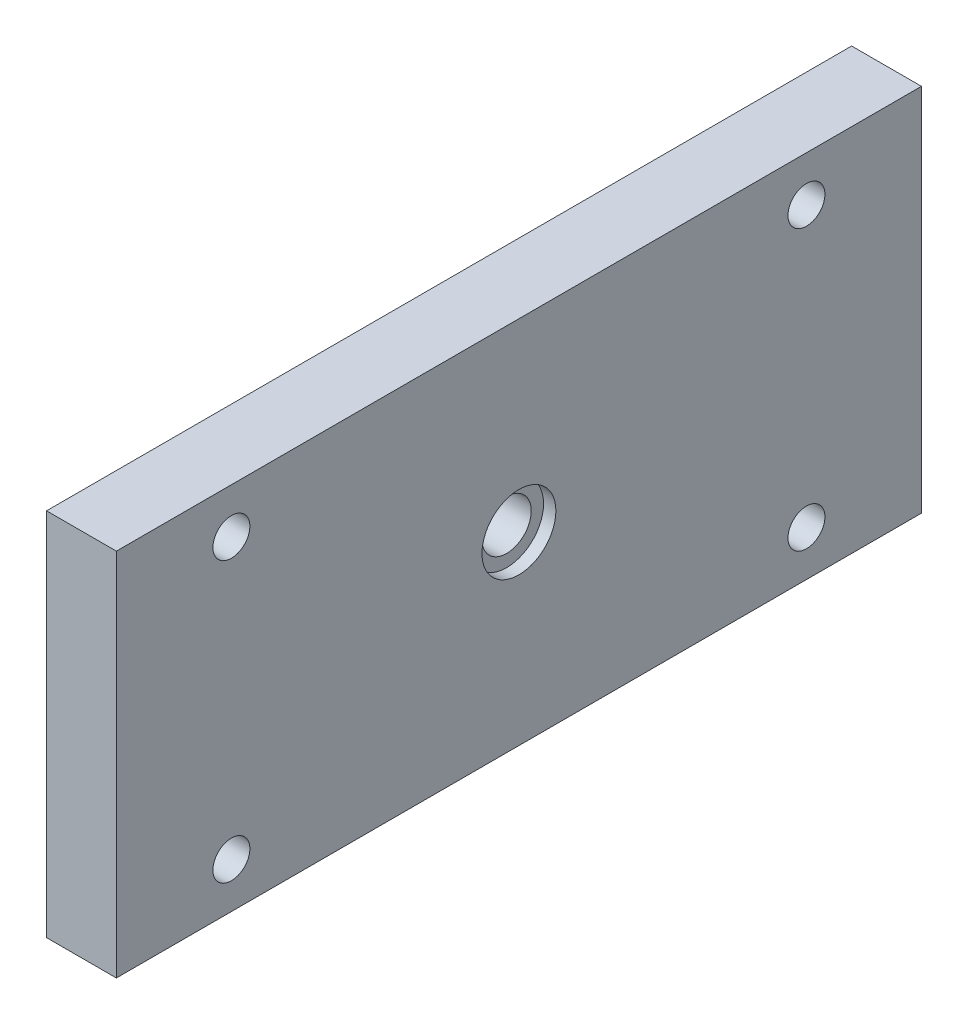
ISO-10303-21;
HEADER;
FILE_DESCRIPTION(('STEP AP214'),'2;1');
FILE_NAME('part.step','',(''),(''),'','','');
FILE_SCHEMA(('AUTOMOTIVE_DESIGN { 1 0 10303 214 1 1 1 1 }'));
ENDSEC;
DATA;
#1=APPLICATION_CONTEXT('core data for automotive mechanical design processes');
#2=APPLICATION_PROTOCOL_DEFINITION('international standard','automotive_design',2000,#1);
#3=PRODUCT_CONTEXT('',#1,'mechanical');
#4=PRODUCT('Part','Part','',(#3));
#5=PRODUCT_RELATED_PRODUCT_CATEGORY('part','',(#4));
#6=PRODUCT_DEFINITION_FORMATION('','',#4);
#7=PRODUCT_DEFINITION_CONTEXT('part definition',#1,'design');
#8=PRODUCT_DEFINITION('design','',#6,#7);
#9=PRODUCT_DEFINITION_SHAPE('','',#8);
#10=(LENGTH_UNIT() NAMED_UNIT(*) SI_UNIT(.MILLI.,.METRE.));
#11=(NAMED_UNIT(*) PLANE_ANGLE_UNIT() SI_UNIT($,.RADIAN.));
#12=(NAMED_UNIT(*) SI_UNIT($,.STERADIAN.) SOLID_ANGLE_UNIT());
#13=UNCERTAINTY_MEASURE_WITH_UNIT(LENGTH_MEASURE(1.E-05),#10,'distance_accuracy_value','');
#14=(GEOMETRIC_REPRESENTATION_CONTEXT(3) GLOBAL_UNCERTAINTY_ASSIGNED_CONTEXT((#13)) GLOBAL_UNIT_ASSIGNED_CONTEXT((#10,
#11,#12)) REPRESENTATION_CONTEXT('',''));
#15=CARTESIAN_POINT('',(0.,0.,0.));
#16=DIRECTION('',(0.,0.,1.));
#17=DIRECTION('',(1.,0.,0.));
#18=AXIS2_PLACEMENT_3D('',#15,#16,#17);
#19=CARTESIAN_POINT('',(-128.,78.0000000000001,98.0000000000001));
#20=DIRECTION('',(-1.,0.,0.));
#21=DIRECTION('',(0.,0.,1.));
#22=AXIS2_PLACEMENT_3D('',#19,#20,#21);
#23=CYLINDRICAL_SURFACE('',#22,6.);
#24=CARTESIAN_POINT('',(-145.,78.0000000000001,98.0000000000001));
#25=DIRECTION('',(-1.,0.,0.));
#26=DIRECTION('',(0.,0.,1.));
#27=AXIS2_PLACEMENT_3D('',#24,#25,#26);
#28=CIRCLE('',#27,6.);
#29=CARTESIAN_POINT('',(-145.,78.0000000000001,104.));
#30=VERTEX_POINT('',#29);
#31=EDGE_CURVE('E93',#30,#30,#28,.T.);
#32=ORIENTED_EDGE('',*,*,#31,.T.);
#33=EDGE_LOOP('',(#32));
#34=FACE_BOUND('',#33,.T.);
#35=CARTESIAN_POINT('',(-131.,78.0000000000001,98.0000000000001));
#36=DIRECTION('',(1.,0.,0.));
#37=DIRECTION('',(0.,0.,-1.));
#38=AXIS2_PLACEMENT_3D('',#35,#36,#37);
#39=CIRCLE('',#38,6.);
#40=CARTESIAN_POINT('',(-131.,78.0000000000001,92.0000000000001));
#41=VERTEX_POINT('',#40);
#42=EDGE_CURVE('E36',#41,#41,#39,.F.);
#43=ORIENTED_EDGE('',*,*,#42,.F.);
#44=EDGE_LOOP('',(#43));
#45=FACE_BOUND('',#44,.T.);
#46=ADVANCED_FACE('F32',(#34,#45),#23,.F.);
#47=CARTESIAN_POINT('',(-145.,78.0000000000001,98.0000000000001));
#48=DIRECTION('',(-1.,0.,0.));
#49=DIRECTION('',(0.,0.,1.));
#50=AXIS2_PLACEMENT_3D('',#47,#48,#49);
#51=PLANE('',#50);
#52=ORIENTED_EDGE('',*,*,#31,.F.);
#53=EDGE_LOOP('',(#52));
#54=FACE_BOUND('',#53,.T.);
#55=CARTESIAN_POINT('',(-145.,112.,184.));
#56=DIRECTION('',(-1.,0.,0.));
#57=DIRECTION('',(0.,0.,1.));
#58=AXIS2_PLACEMENT_3D('',#55,#56,#57);
#59=CIRCLE('',#58,1.65);
#60=CARTESIAN_POINT('',(-145.,112.,185.65));
#61=VERTEX_POINT('',#60);
#62=EDGE_CURVE('E92',#61,#61,#59,.T.);
#63=ORIENTED_EDGE('',*,*,#62,.F.);
#64=EDGE_LOOP('',(#63));
#65=FACE_BOUND('',#64,.T.);
#66=CARTESIAN_POINT('',(-145.,112.,12.));
#67=DIRECTION('',(-1.,0.,0.));
#68=DIRECTION('',(0.,0.,1.));
#69=AXIS2_PLACEMENT_3D('',#66,#67,#68);
#70=CIRCLE('',#69,1.65);
#71=CARTESIAN_POINT('',(-145.,112.,13.65));
#72=VERTEX_POINT('',#71);
#73=EDGE_CURVE('E103',#72,#72,#70,.T.);
#74=ORIENTED_EDGE('',*,*,#73,.F.);
#75=EDGE_LOOP('',(#74));
#76=FACE_BOUND('',#75,.T.);
#77=CARTESIAN_POINT('',(-145.,44.,184.));
#78=DIRECTION('',(-1.,0.,0.));
#79=DIRECTION('',(0.,0.,1.));
#80=AXIS2_PLACEMENT_3D('',#77,#78,#79);
#81=CIRCLE('',#80,1.65);
#82=CARTESIAN_POINT('',(-145.,44.,185.65));
#83=VERTEX_POINT('',#82);
#84=EDGE_CURVE('E107',#83,#83,#81,.T.);
#85=ORIENTED_EDGE('',*,*,#84,.F.);
#86=EDGE_LOOP('',(#85));
#87=FACE_BOUND('',#86,.T.);
#88=CARTESIAN_POINT('',(-145.,44.,12.));
#89=DIRECTION('',(-1.,0.,0.));
#90=DIRECTION('',(0.,0.,1.));
#91=AXIS2_PLACEMENT_3D('',#88,#89,#90);
#92=CIRCLE('',#91,1.65);
#93=CARTESIAN_POINT('',(-145.,44.,13.65));
#94=VERTEX_POINT('',#93);
#95=EDGE_CURVE('E111',#94,#94,#92,.T.);
#96=ORIENTED_EDGE('',*,*,#95,.F.);
#97=EDGE_LOOP('',(#96));
#98=FACE_BOUND('',#97,.T.);
#99=CARTESIAN_POINT('',(-145.,112.,168.));
#100=DIRECTION('',(-1.,0.,0.));
#101=DIRECTION('',(0.,0.,1.));
#102=AXIS2_PLACEMENT_3D('',#99,#100,#101);
#103=CIRCLE('',#102,7.5);
#104=CARTESIAN_POINT('',(-145.,112.,175.5));
#105=VERTEX_POINT('',#104);
#106=EDGE_CURVE('E123',#105,#105,#103,.T.);
#107=ORIENTED_EDGE('',*,*,#106,.F.);
#108=EDGE_LOOP('',(#107));
#109=FACE_BOUND('',#108,.T.);
#110=CARTESIAN_POINT('',(-145.,112.,28.));
#111=DIRECTION('',(-1.,0.,0.));
#112=DIRECTION('',(0.,0.,1.));
#113=AXIS2_PLACEMENT_3D('',#110,#111,#112);
#114=CIRCLE('',#113,7.5);
#115=CARTESIAN_POINT('',(-145.,112.,35.5));
#116=VERTEX_POINT('',#115);
#117=EDGE_CURVE('E131',#116,#116,#114,.T.);
#118=ORIENTED_EDGE('',*,*,#117,.F.);
#119=EDGE_LOOP('',(#118));
#120=FACE_BOUND('',#119,.T.);
#121=CARTESIAN_POINT('',(-145.,44.,168.));
#122=DIRECTION('',(-1.,0.,0.));
#123=DIRECTION('',(0.,0.,1.));
#124=AXIS2_PLACEMENT_3D('',#121,#122,#123);
#125=CIRCLE('',#124,7.5);
#126=CARTESIAN_POINT('',(-145.,44.,175.5));
#127=VERTEX_POINT('',#126);
#128=EDGE_CURVE('E139',#127,#127,#125,.T.);
#129=ORIENTED_EDGE('',*,*,#128,.F.);
#130=EDGE_LOOP('',(#129));
#131=FACE_BOUND('',#130,.T.);
#132=CARTESIAN_POINT('',(-145.,44.,28.));
#133=DIRECTION('',(-1.,0.,0.));
#134=DIRECTION('',(0.,0.,1.));
#135=AXIS2_PLACEMENT_3D('',#132,#133,#134);
#136=CIRCLE('',#135,7.5);
#137=CARTESIAN_POINT('',(-145.,44.,35.5));
#138=VERTEX_POINT('',#137);
#139=EDGE_CURVE('E147',#138,#138,#136,.T.);
#140=ORIENTED_EDGE('',*,*,#139,.F.);
#141=EDGE_LOOP('',(#140));
#142=FACE_BOUND('',#141,.T.);
#143=DIRECTION('',(0.,0.,-1.));
#144=VECTOR('',#143,1.);
#145=CARTESIAN_POINT('',(-145.,33.,98.0000000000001));
#146=LINE('',#145,#144);
#147=CARTESIAN_POINT('',(-145.,33.,196.));
#148=VERTEX_POINT('',#147);
#149=CARTESIAN_POINT('',(-145.,33.,0.));
#150=VERTEX_POINT('',#149);
#151=EDGE_CURVE('E11',#148,#150,#146,.T.);
#152=ORIENTED_EDGE('',*,*,#151,.F.);
#153=DIRECTION('',(0.,-1.,0.));
#154=VECTOR('',#153,1.);
#155=CARTESIAN_POINT('',(-145.,78.0000000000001,196.));
#156=LINE('',#155,#154);
#157=CARTESIAN_POINT('',(-145.,123.,196.));
#158=VERTEX_POINT('',#157);
#159=EDGE_CURVE('E166',#158,#148,#156,.T.);
#160=ORIENTED_EDGE('',*,*,#159,.F.);
#161=DIRECTION('',(0.,0.,1.));
#162=VECTOR('',#161,1.);
#163=CARTESIAN_POINT('',(-145.,123.,98.0000000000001));
#164=LINE('',#163,#162);
#165=CARTESIAN_POINT('',(-145.,123.,0.));
#166=VERTEX_POINT('',#165);
#167=EDGE_CURVE('E169',#166,#158,#164,.T.);
#168=ORIENTED_EDGE('',*,*,#167,.F.);
#169=DIRECTION('',(0.,1.,0.));
#170=VECTOR('',#169,1.);
#171=CARTESIAN_POINT('',(-145.,78.0000000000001,0.));
#172=LINE('',#171,#170);
#173=EDGE_CURVE('E41',#150,#166,#172,.T.);
#174=ORIENTED_EDGE('',*,*,#173,.F.);
#175=EDGE_LOOP('',(#152,#160,#168,#174));
#176=FACE_BOUND('',#175,.T.);
#177=ADVANCED_FACE('F34',(#54,#65,#76,#87,#98,#109,#120,#131,#142,#176),#51,.T.);
#178=CARTESIAN_POINT('',(-128.,33.,98.0000000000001));
#179=DIRECTION('',(0.,-1.,0.));
#180=DIRECTION('',(1.,0.,0.));
#181=AXIS2_PLACEMENT_3D('',#178,#179,#180);
#182=PLANE('',#181);
#183=DIRECTION('',(-1.,0.,0.));
#184=VECTOR('',#183,1.);
#185=CARTESIAN_POINT('',(-128.,33.,196.));
#186=LINE('',#185,#184);
#187=CARTESIAN_POINT('',(-128.,33.,196.));
#188=VERTEX_POINT('',#187);
#189=EDGE_CURVE('E151',#188,#148,#186,.T.);
#190=ORIENTED_EDGE('',*,*,#189,.T.);
#191=ORIENTED_EDGE('',*,*,#151,.T.);
#192=DIRECTION('',(-1.,0.,0.));
#193=VECTOR('',#192,1.);
#194=CARTESIAN_POINT('',(-128.,33.,0.));
#195=LINE('',#194,#193);
#196=CARTESIAN_POINT('',(-128.,33.,0.));
#197=VERTEX_POINT('',#196);
#198=EDGE_CURVE('E164',#197,#150,#195,.T.);
#199=ORIENTED_EDGE('',*,*,#198,.F.);
#200=DIRECTION('',(0.,0.,1.));
#201=VECTOR('',#200,1.);
#202=CARTESIAN_POINT('',(-128.,33.,98.0000000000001));
#203=LINE('',#202,#201);
#204=EDGE_CURVE('E143',#197,#188,#203,.T.);
#205=ORIENTED_EDGE('',*,*,#204,.T.);
#206=EDGE_LOOP('',(#190,#191,#199,#205));
#207=FACE_BOUND('',#206,.T.);
#208=ADVANCED_FACE('F199',(#207),#182,.T.);
#209=CARTESIAN_POINT('',(-128.,78.0000000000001,0.));
#210=DIRECTION('',(0.,0.,-1.));
#211=DIRECTION('',(-1.,0.,0.));
#212=AXIS2_PLACEMENT_3D('',#209,#210,#211);
#213=PLANE('',#212);
#214=ORIENTED_EDGE('',*,*,#198,.T.);
#215=ORIENTED_EDGE('',*,*,#173,.T.);
#216=DIRECTION('',(-1.,0.,0.));
#217=VECTOR('',#216,1.);
#218=CARTESIAN_POINT('',(-128.,123.,0.));
#219=LINE('',#218,#217);
#220=CARTESIAN_POINT('',(-128.,123.,0.));
#221=VERTEX_POINT('',#220);
#222=EDGE_CURVE('E161',#221,#166,#219,.T.);
#223=ORIENTED_EDGE('',*,*,#222,.F.);
#224=DIRECTION('',(0.,-1.,0.));
#225=VECTOR('',#224,1.);
#226=CARTESIAN_POINT('',(-128.,78.0000000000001,0.));
#227=LINE('',#226,#225);
#228=EDGE_CURVE('E146',#221,#197,#227,.T.);
#229=ORIENTED_EDGE('',*,*,#228,.T.);
#230=EDGE_LOOP('',(#214,#215,#223,#229));
#231=FACE_BOUND('',#230,.T.);
#232=ADVANCED_FACE('F224',(#231),#213,.T.);
#233=CARTESIAN_POINT('',(-128.,123.,98.0000000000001));
#234=DIRECTION('',(0.,1.,0.));
#235=DIRECTION('',(-1.,0.,0.));
#236=AXIS2_PLACEMENT_3D('',#233,#234,#235);
#237=PLANE('',#236);
#238=ORIENTED_EDGE('',*,*,#222,.T.);
#239=ORIENTED_EDGE('',*,*,#167,.T.);
#240=DIRECTION('',(-1.,0.,0.));
#241=VECTOR('',#240,1.);
#242=CARTESIAN_POINT('',(-128.,123.,196.));
#243=LINE('',#242,#241);
#244=CARTESIAN_POINT('',(-128.,123.,196.));
#245=VERTEX_POINT('',#244);
#246=EDGE_CURVE('E158',#245,#158,#243,.T.);
#247=ORIENTED_EDGE('',*,*,#246,.F.);
#248=DIRECTION('',(0.,0.,-1.));
#249=VECTOR('',#248,1.);
#250=CARTESIAN_POINT('',(-128.,123.,98.0000000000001));
#251=LINE('',#250,#249);
#252=EDGE_CURVE('E152',#245,#221,#251,.T.);
#253=ORIENTED_EDGE('',*,*,#252,.T.);
#254=EDGE_LOOP('',(#238,#239,#247,#253));
#255=FACE_BOUND('',#254,.T.);
#256=ADVANCED_FACE('F223',(#255),#237,.T.);
#257=CARTESIAN_POINT('',(-128.,78.0000000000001,98.0000000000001));
#258=DIRECTION('',(1.,0.,0.));
#259=DIRECTION('',(0.,0.,-1.));
#260=AXIS2_PLACEMENT_3D('',#257,#258,#259);
#261=PLANE('',#260);
#262=CARTESIAN_POINT('',(-128.,78.0000000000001,98.0000000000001));
#263=DIRECTION('',(1.,0.,0.));
#264=DIRECTION('',(0.,0.,-1.));
#265=AXIS2_PLACEMENT_3D('',#262,#263,#264);
#266=CIRCLE('',#265,8.99999999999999);
#267=CARTESIAN_POINT('',(-128.,78.0000000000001,89.0000000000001));
#268=VERTEX_POINT('',#267);
#269=EDGE_CURVE('E427',#268,#268,#266,.T.);
#270=ORIENTED_EDGE('',*,*,#269,.F.);
#271=EDGE_LOOP('',(#270));
#272=FACE_BOUND('',#271,.T.);
#273=CARTESIAN_POINT('',(-128.,112.,168.));
#274=DIRECTION('',(1.,0.,0.));
#275=DIRECTION('',(0.,0.,-1.));
#276=AXIS2_PLACEMENT_3D('',#273,#274,#275);
#277=CIRCLE('',#276,4.5);
#278=CARTESIAN_POINT('',(-128.,112.,163.5));
#279=VERTEX_POINT('',#278);
#280=EDGE_CURVE('E118',#279,#279,#277,.T.);
#281=ORIENTED_EDGE('',*,*,#280,.F.);
#282=EDGE_LOOP('',(#281));
#283=FACE_BOUND('',#282,.T.);
#284=CARTESIAN_POINT('',(-128.,112.,28.));
#285=DIRECTION('',(1.,0.,0.));
#286=DIRECTION('',(0.,0.,-1.));
#287=AXIS2_PLACEMENT_3D('',#284,#285,#286);
#288=CIRCLE('',#287,4.5);
#289=CARTESIAN_POINT('',(-128.,112.,23.5));
#290=VERTEX_POINT('',#289);
#291=EDGE_CURVE('E126',#290,#290,#288,.T.);
#292=ORIENTED_EDGE('',*,*,#291,.F.);
#293=EDGE_LOOP('',(#292));
#294=FACE_BOUND('',#293,.T.);
#295=CARTESIAN_POINT('',(-128.,44.,168.));
#296=DIRECTION('',(1.,0.,0.));
#297=DIRECTION('',(0.,0.,-1.));
#298=AXIS2_PLACEMENT_3D('',#295,#296,#297);
#299=CIRCLE('',#298,4.5);
#300=CARTESIAN_POINT('',(-128.,44.,163.5));
#301=VERTEX_POINT('',#300);
#302=EDGE_CURVE('E134',#301,#301,#299,.T.);
#303=ORIENTED_EDGE('',*,*,#302,.F.);
#304=EDGE_LOOP('',(#303));
#305=FACE_BOUND('',#304,.T.);
#306=CARTESIAN_POINT('',(-128.,44.,28.));
#307=DIRECTION('',(1.,0.,0.));
#308=DIRECTION('',(0.,0.,-1.));
#309=AXIS2_PLACEMENT_3D('',#306,#307,#308);
#310=CIRCLE('',#309,4.5);
#311=CARTESIAN_POINT('',(-128.,44.,23.5));
#312=VERTEX_POINT('',#311);
#313=EDGE_CURVE('E142',#312,#312,#310,.T.);
#314=ORIENTED_EDGE('',*,*,#313,.F.);
#315=EDGE_LOOP('',(#314));
#316=FACE_BOUND('',#315,.T.);
#317=DIRECTION('',(0.,1.,0.));
#318=VECTOR('',#317,1.);
#319=CARTESIAN_POINT('',(-128.,78.0000000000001,196.));
#320=LINE('',#319,#318);
#321=EDGE_CURVE('E148',#188,#245,#320,.T.);
#322=ORIENTED_EDGE('',*,*,#321,.F.);
#323=ORIENTED_EDGE('',*,*,#204,.F.);
#324=ORIENTED_EDGE('',*,*,#228,.F.);
#325=ORIENTED_EDGE('',*,*,#252,.F.);
#326=EDGE_LOOP('',(#322,#323,#324,#325));
#327=FACE_BOUND('',#326,.T.);
#328=ADVANCED_FACE('F221',(#272,#283,#294,#305,#316,#327),#261,.T.);
#329=CARTESIAN_POINT('',(-128.,78.0000000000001,196.));
#330=DIRECTION('',(0.,0.,1.));
#331=DIRECTION('',(1.,0.,0.));
#332=AXIS2_PLACEMENT_3D('',#329,#330,#331);
#333=PLANE('',#332);
#334=ORIENTED_EDGE('',*,*,#321,.T.);
#335=ORIENTED_EDGE('',*,*,#246,.T.);
#336=ORIENTED_EDGE('',*,*,#159,.T.);
#337=ORIENTED_EDGE('',*,*,#189,.F.);
#338=EDGE_LOOP('',(#334,#335,#336,#337));
#339=FACE_BOUND('',#338,.T.);
#340=ADVANCED_FACE('F215',(#339),#333,.T.);
#341=CARTESIAN_POINT('',(-145.,44.,28.));
#342=DIRECTION('',(-1.,0.,0.));
#343=DIRECTION('',(0.,0.,1.));
#344=AXIS2_PLACEMENT_3D('',#341,#342,#343);
#345=CYLINDRICAL_SURFACE('',#344,4.5);
#346=ORIENTED_EDGE('',*,*,#313,.T.);
#347=EDGE_LOOP('',(#346));
#348=FACE_BOUND('',#347,.T.);
#349=CARTESIAN_POINT('',(-136.,44.,28.));
#350=DIRECTION('',(-1.,0.,0.));
#351=DIRECTION('',(0.,0.,1.));
#352=AXIS2_PLACEMENT_3D('',#349,#350,#351);
#353=CIRCLE('',#352,4.5);
#354=CARTESIAN_POINT('',(-136.,44.,32.5));
#355=VERTEX_POINT('',#354);
#356=EDGE_CURVE('E138',#355,#355,#353,.T.);
#357=ORIENTED_EDGE('',*,*,#356,.T.);
#358=EDGE_LOOP('',(#357));
#359=FACE_BOUND('',#358,.T.);
#360=ADVANCED_FACE('F311',(#348,#359),#345,.F.);
#361=CARTESIAN_POINT('',(-136.,51.5000000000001,28.));
#362=DIRECTION('',(1.,0.,0.));
#363=DIRECTION('',(0.,0.,-1.));
#364=AXIS2_PLACEMENT_3D('',#361,#362,#363);
#365=PLANE('',#364);
#366=ORIENTED_EDGE('',*,*,#356,.F.);
#367=EDGE_LOOP('',(#366));
#368=FACE_BOUND('',#367,.T.);
#369=CARTESIAN_POINT('',(-136.,44.,28.));
#370=DIRECTION('',(-1.,0.,0.));
#371=DIRECTION('',(0.,0.,1.));
#372=AXIS2_PLACEMENT_3D('',#369,#370,#371);
#373=CIRCLE('',#372,7.5);
#374=CARTESIAN_POINT('',(-136.,44.,35.5));
#375=VERTEX_POINT('',#374);
#376=EDGE_CURVE('E135',#375,#375,#373,.T.);
#377=ORIENTED_EDGE('',*,*,#376,.T.);
#378=EDGE_LOOP('',(#377));
#379=FACE_BOUND('',#378,.T.);
#380=ADVANCED_FACE('F307',(#368,#379),#365,.F.);
#381=CARTESIAN_POINT('',(-145.,44.,28.));
#382=DIRECTION('',(-1.,0.,0.));
#383=DIRECTION('',(0.,0.,1.));
#384=AXIS2_PLACEMENT_3D('',#381,#382,#383);
#385=CYLINDRICAL_SURFACE('',#384,7.5);
#386=ORIENTED_EDGE('',*,*,#139,.T.);
#387=EDGE_LOOP('',(#386));
#388=FACE_BOUND('',#387,.T.);
#389=ORIENTED_EDGE('',*,*,#376,.F.);
#390=EDGE_LOOP('',(#389));
#391=FACE_BOUND('',#390,.T.);
#392=ADVANCED_FACE('F303',(#388,#391),#385,.F.);
#393=CARTESIAN_POINT('',(-145.,44.,168.));
#394=DIRECTION('',(-1.,0.,0.));
#395=DIRECTION('',(0.,0.,1.));
#396=AXIS2_PLACEMENT_3D('',#393,#394,#395);
#397=CYLINDRICAL_SURFACE('',#396,4.5);
#398=ORIENTED_EDGE('',*,*,#302,.T.);
#399=EDGE_LOOP('',(#398));
#400=FACE_BOUND('',#399,.T.);
#401=CARTESIAN_POINT('',(-136.,44.,168.));
#402=DIRECTION('',(-1.,0.,0.));
#403=DIRECTION('',(0.,0.,1.));
#404=AXIS2_PLACEMENT_3D('',#401,#402,#403);
#405=CIRCLE('',#404,4.5);
#406=CARTESIAN_POINT('',(-136.,44.,172.5));
#407=VERTEX_POINT('',#406);
#408=EDGE_CURVE('E130',#407,#407,#405,.T.);
#409=ORIENTED_EDGE('',*,*,#408,.T.);
#410=EDGE_LOOP('',(#409));
#411=FACE_BOUND('',#410,.T.);
#412=ADVANCED_FACE('F299',(#400,#411),#397,.F.);
#413=CARTESIAN_POINT('',(-136.,51.5000000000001,168.));
#414=DIRECTION('',(1.,0.,0.));
#415=DIRECTION('',(0.,0.,-1.));
#416=AXIS2_PLACEMENT_3D('',#413,#414,#415);
#417=PLANE('',#416);
#418=ORIENTED_EDGE('',*,*,#408,.F.);
#419=EDGE_LOOP('',(#418));
#420=FACE_BOUND('',#419,.T.);
#421=CARTESIAN_POINT('',(-136.,44.,168.));
#422=DIRECTION('',(-1.,0.,0.));
#423=DIRECTION('',(0.,0.,1.));
#424=AXIS2_PLACEMENT_3D('',#421,#422,#423);
#425=CIRCLE('',#424,7.5);
#426=CARTESIAN_POINT('',(-136.,44.,175.5));
#427=VERTEX_POINT('',#426);
#428=EDGE_CURVE('E127',#427,#427,#425,.T.);
#429=ORIENTED_EDGE('',*,*,#428,.T.);
#430=EDGE_LOOP('',(#429));
#431=FACE_BOUND('',#430,.T.);
#432=ADVANCED_FACE('F295',(#420,#431),#417,.F.);
#433=CARTESIAN_POINT('',(-145.,44.,168.));
#434=DIRECTION('',(-1.,0.,0.));
#435=DIRECTION('',(0.,0.,1.));
#436=AXIS2_PLACEMENT_3D('',#433,#434,#435);
#437=CYLINDRICAL_SURFACE('',#436,7.5);
#438=ORIENTED_EDGE('',*,*,#128,.T.);
#439=EDGE_LOOP('',(#438));
#440=FACE_BOUND('',#439,.T.);
#441=ORIENTED_EDGE('',*,*,#428,.F.);
#442=EDGE_LOOP('',(#441));
#443=FACE_BOUND('',#442,.T.);
#444=ADVANCED_FACE('F291',(#440,#443),#437,.F.);
#445=CARTESIAN_POINT('',(-145.,112.,28.));
#446=DIRECTION('',(-1.,0.,0.));
#447=DIRECTION('',(0.,0.,1.));
#448=AXIS2_PLACEMENT_3D('',#445,#446,#447);
#449=CYLINDRICAL_SURFACE('',#448,4.5);
#450=ORIENTED_EDGE('',*,*,#291,.T.);
#451=EDGE_LOOP('',(#450));
#452=FACE_BOUND('',#451,.T.);
#453=CARTESIAN_POINT('',(-136.,112.,28.));
#454=DIRECTION('',(-1.,0.,0.));
#455=DIRECTION('',(0.,0.,1.));
#456=AXIS2_PLACEMENT_3D('',#453,#454,#455);
#457=CIRCLE('',#456,4.5);
#458=CARTESIAN_POINT('',(-136.,112.,32.5));
#459=VERTEX_POINT('',#458);
#460=EDGE_CURVE('E122',#459,#459,#457,.T.);
#461=ORIENTED_EDGE('',*,*,#460,.T.);
#462=EDGE_LOOP('',(#461));
#463=FACE_BOUND('',#462,.T.);
#464=ADVANCED_FACE('F287',(#452,#463),#449,.F.);
#465=CARTESIAN_POINT('',(-136.,119.5,28.));
#466=DIRECTION('',(1.,0.,0.));
#467=DIRECTION('',(0.,0.,-1.));
#468=AXIS2_PLACEMENT_3D('',#465,#466,#467);
#469=PLANE('',#468);
#470=ORIENTED_EDGE('',*,*,#460,.F.);
#471=EDGE_LOOP('',(#470));
#472=FACE_BOUND('',#471,.T.);
#473=CARTESIAN_POINT('',(-136.,112.,28.));
#474=DIRECTION('',(-1.,0.,0.));
#475=DIRECTION('',(0.,0.,1.));
#476=AXIS2_PLACEMENT_3D('',#473,#474,#475);
#477=CIRCLE('',#476,7.5);
#478=CARTESIAN_POINT('',(-136.,112.,35.5));
#479=VERTEX_POINT('',#478);
#480=EDGE_CURVE('E119',#479,#479,#477,.T.);
#481=ORIENTED_EDGE('',*,*,#480,.T.);
#482=EDGE_LOOP('',(#481));
#483=FACE_BOUND('',#482,.T.);
#484=ADVANCED_FACE('F283',(#472,#483),#469,.F.);
#485=CARTESIAN_POINT('',(-145.,112.,28.));
#486=DIRECTION('',(-1.,0.,0.));
#487=DIRECTION('',(0.,0.,1.));
#488=AXIS2_PLACEMENT_3D('',#485,#486,#487);
#489=CYLINDRICAL_SURFACE('',#488,7.5);
#490=ORIENTED_EDGE('',*,*,#117,.T.);
#491=EDGE_LOOP('',(#490));
#492=FACE_BOUND('',#491,.T.);
#493=ORIENTED_EDGE('',*,*,#480,.F.);
#494=EDGE_LOOP('',(#493));
#495=FACE_BOUND('',#494,.T.);
#496=ADVANCED_FACE('F279',(#492,#495),#489,.F.);
#497=CARTESIAN_POINT('',(-145.,112.,168.));
#498=DIRECTION('',(-1.,0.,0.));
#499=DIRECTION('',(0.,0.,1.));
#500=AXIS2_PLACEMENT_3D('',#497,#498,#499);
#501=CYLINDRICAL_SURFACE('',#500,4.5);
#502=ORIENTED_EDGE('',*,*,#280,.T.);
#503=EDGE_LOOP('',(#502));
#504=FACE_BOUND('',#503,.T.);
#505=CARTESIAN_POINT('',(-136.,112.,168.));
#506=DIRECTION('',(-1.,0.,0.));
#507=DIRECTION('',(0.,0.,1.));
#508=AXIS2_PLACEMENT_3D('',#505,#506,#507);
#509=CIRCLE('',#508,4.5);
#510=CARTESIAN_POINT('',(-136.,112.,172.5));
#511=VERTEX_POINT('',#510);
#512=EDGE_CURVE('E115',#511,#511,#509,.T.);
#513=ORIENTED_EDGE('',*,*,#512,.T.);
#514=EDGE_LOOP('',(#513));
#515=FACE_BOUND('',#514,.T.);
#516=ADVANCED_FACE('F275',(#504,#515),#501,.F.);
#517=CARTESIAN_POINT('',(-136.,119.5,168.));
#518=DIRECTION('',(1.,0.,0.));
#519=DIRECTION('',(0.,0.,-1.));
#520=AXIS2_PLACEMENT_3D('',#517,#518,#519);
#521=PLANE('',#520);
#522=ORIENTED_EDGE('',*,*,#512,.F.);
#523=EDGE_LOOP('',(#522));
#524=FACE_BOUND('',#523,.T.);
#525=CARTESIAN_POINT('',(-136.,112.,168.));
#526=DIRECTION('',(-1.,0.,0.));
#527=DIRECTION('',(0.,0.,1.));
#528=AXIS2_PLACEMENT_3D('',#525,#526,#527);
#529=CIRCLE('',#528,7.5);
#530=CARTESIAN_POINT('',(-136.,112.,175.5));
#531=VERTEX_POINT('',#530);
#532=EDGE_CURVE('E112',#531,#531,#529,.T.);
#533=ORIENTED_EDGE('',*,*,#532,.T.);
#534=EDGE_LOOP('',(#533));
#535=FACE_BOUND('',#534,.T.);
#536=ADVANCED_FACE('F271',(#524,#535),#521,.F.);
#537=CARTESIAN_POINT('',(-145.,112.,168.));
#538=DIRECTION('',(-1.,0.,0.));
#539=DIRECTION('',(0.,0.,1.));
#540=AXIS2_PLACEMENT_3D('',#537,#538,#539);
#541=CYLINDRICAL_SURFACE('',#540,7.5);
#542=ORIENTED_EDGE('',*,*,#106,.T.);
#543=EDGE_LOOP('',(#542));
#544=FACE_BOUND('',#543,.T.);
#545=ORIENTED_EDGE('',*,*,#532,.F.);
#546=EDGE_LOOP('',(#545));
#547=FACE_BOUND('',#546,.T.);
#548=ADVANCED_FACE('F267',(#544,#547),#541,.F.);
#549=CARTESIAN_POINT('',(-134.,44.,12.));
#550=DIRECTION('',(-1.,0.,0.));
#551=DIRECTION('',(0.,0.,1.));
#552=AXIS2_PLACEMENT_3D('',#549,#550,#551);
#553=CONICAL_SURFACE('',#552,1.65,1.18681170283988);
#554=CARTESIAN_POINT('',(-133.333333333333,44.,12.));
#555=VERTEX_POINT('',#554);
#556=VERTEX_LOOP('',#555);
#557=FACE_BOUND('',#556,.T.);
#558=CARTESIAN_POINT('',(-134.,44.,12.));
#559=DIRECTION('',(-1.,0.,0.));
#560=DIRECTION('',(0.,0.,1.));
#561=AXIS2_PLACEMENT_3D('',#558,#559,#560);
#562=CIRCLE('',#561,1.65);
#563=CARTESIAN_POINT('',(-134.,44.,13.65));
#564=VERTEX_POINT('',#563);
#565=EDGE_CURVE('E108',#564,#564,#562,.T.);
#566=ORIENTED_EDGE('',*,*,#565,.T.);
#567=EDGE_LOOP('',(#566));
#568=FACE_BOUND('',#567,.T.);
#569=ADVANCED_FACE('F263',(#557,#568),#553,.F.);
#570=CARTESIAN_POINT('',(-145.,44.,12.));
#571=DIRECTION('',(-1.,0.,0.));
#572=DIRECTION('',(0.,0.,1.));
#573=AXIS2_PLACEMENT_3D('',#570,#571,#572);
#574=CYLINDRICAL_SURFACE('',#573,1.65);
#575=ORIENTED_EDGE('',*,*,#95,.T.);
#576=EDGE_LOOP('',(#575));
#577=FACE_BOUND('',#576,.T.);
#578=ORIENTED_EDGE('',*,*,#565,.F.);
#579=EDGE_LOOP('',(#578));
#580=FACE_BOUND('',#579,.T.);
#581=ADVANCED_FACE('F259',(#577,#580),#574,.F.);
#582=CARTESIAN_POINT('',(-134.,44.,184.));
#583=DIRECTION('',(-1.,0.,0.));
#584=DIRECTION('',(0.,0.,1.));
#585=AXIS2_PLACEMENT_3D('',#582,#583,#584);
#586=CONICAL_SURFACE('',#585,1.65,1.18681170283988);
#587=CARTESIAN_POINT('',(-133.333333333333,44.,184.));
#588=VERTEX_POINT('',#587);
#589=VERTEX_LOOP('',#588);
#590=FACE_BOUND('',#589,.T.);
#591=CARTESIAN_POINT('',(-134.,44.,184.));
#592=DIRECTION('',(-1.,0.,0.));
#593=DIRECTION('',(0.,0.,1.));
#594=AXIS2_PLACEMENT_3D('',#591,#592,#593);
#595=CIRCLE('',#594,1.65);
#596=CARTESIAN_POINT('',(-134.,44.,185.65));
#597=VERTEX_POINT('',#596);
#598=EDGE_CURVE('E104',#597,#597,#595,.T.);
#599=ORIENTED_EDGE('',*,*,#598,.T.);
#600=EDGE_LOOP('',(#599));
#601=FACE_BOUND('',#600,.T.);
#602=ADVANCED_FACE('F255',(#590,#601),#586,.F.);
#603=CARTESIAN_POINT('',(-145.,44.,184.));
#604=DIRECTION('',(-1.,0.,0.));
#605=DIRECTION('',(0.,0.,1.));
#606=AXIS2_PLACEMENT_3D('',#603,#604,#605);
#607=CYLINDRICAL_SURFACE('',#606,1.65);
#608=ORIENTED_EDGE('',*,*,#84,.T.);
#609=EDGE_LOOP('',(#608));
#610=FACE_BOUND('',#609,.T.);
#611=ORIENTED_EDGE('',*,*,#598,.F.);
#612=EDGE_LOOP('',(#611));
#613=FACE_BOUND('',#612,.T.);
#614=ADVANCED_FACE('F251',(#610,#613),#607,.F.);
#615=CARTESIAN_POINT('',(-134.,112.,12.));
#616=DIRECTION('',(-1.,0.,0.));
#617=DIRECTION('',(0.,0.,1.));
#618=AXIS2_PLACEMENT_3D('',#615,#616,#617);
#619=CONICAL_SURFACE('',#618,1.65,1.18681170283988);
#620=CARTESIAN_POINT('',(-133.333333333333,112.,12.));
#621=VERTEX_POINT('',#620);
#622=VERTEX_LOOP('',#621);
#623=FACE_BOUND('',#622,.T.);
#624=CARTESIAN_POINT('',(-134.,112.,12.));
#625=DIRECTION('',(-1.,0.,0.));
#626=DIRECTION('',(0.,0.,1.));
#627=AXIS2_PLACEMENT_3D('',#624,#625,#626);
#628=CIRCLE('',#627,1.65);
#629=CARTESIAN_POINT('',(-134.,112.,13.65));
#630=VERTEX_POINT('',#629);
#631=EDGE_CURVE('E96',#630,#630,#628,.T.);
#632=ORIENTED_EDGE('',*,*,#631,.T.);
#633=EDGE_LOOP('',(#632));
#634=FACE_BOUND('',#633,.T.);
#635=ADVANCED_FACE('F248',(#623,#634),#619,.F.);
#636=CARTESIAN_POINT('',(-145.,112.,12.));
#637=DIRECTION('',(-1.,0.,0.));
#638=DIRECTION('',(0.,0.,1.));
#639=AXIS2_PLACEMENT_3D('',#636,#637,#638);
#640=CYLINDRICAL_SURFACE('',#639,1.65);
#641=ORIENTED_EDGE('',*,*,#73,.T.);
#642=EDGE_LOOP('',(#641));
#643=FACE_BOUND('',#642,.T.);
#644=ORIENTED_EDGE('',*,*,#631,.F.);
#645=EDGE_LOOP('',(#644));
#646=FACE_BOUND('',#645,.T.);
#647=ADVANCED_FACE('F86',(#643,#646),#640,.F.);
#648=CARTESIAN_POINT('',(-134.,112.,184.));
#649=DIRECTION('',(-1.,0.,0.));
#650=DIRECTION('',(0.,0.,1.));
#651=AXIS2_PLACEMENT_3D('',#648,#649,#650);
#652=CONICAL_SURFACE('',#651,1.65,1.18681170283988);
#653=CARTESIAN_POINT('',(-133.333333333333,112.,184.));
#654=VERTEX_POINT('',#653);
#655=VERTEX_LOOP('',#654);
#656=FACE_BOUND('',#655,.T.);
#657=CARTESIAN_POINT('',(-134.,112.,184.));
#658=DIRECTION('',(-1.,0.,0.));
#659=DIRECTION('',(0.,0.,1.));
#660=AXIS2_PLACEMENT_3D('',#657,#658,#659);
#661=CIRCLE('',#660,1.65);
#662=CARTESIAN_POINT('',(-134.,112.,185.65));
#663=VERTEX_POINT('',#662);
#664=EDGE_CURVE('E90',#663,#663,#661,.T.);
#665=ORIENTED_EDGE('',*,*,#664,.T.);
#666=EDGE_LOOP('',(#665));
#667=FACE_BOUND('',#666,.T.);
#668=ADVANCED_FACE('F82',(#656,#667),#652,.F.);
#669=CARTESIAN_POINT('',(-145.,112.,184.));
#670=DIRECTION('',(-1.,0.,0.));
#671=DIRECTION('',(0.,0.,1.));
#672=AXIS2_PLACEMENT_3D('',#669,#670,#671);
#673=CYLINDRICAL_SURFACE('',#672,1.65);
#674=ORIENTED_EDGE('',*,*,#62,.T.);
#675=EDGE_LOOP('',(#674));
#676=FACE_BOUND('',#675,.T.);
#677=ORIENTED_EDGE('',*,*,#664,.F.);
#678=EDGE_LOOP('',(#677));
#679=FACE_BOUND('',#678,.T.);
#680=ADVANCED_FACE('F85',(#676,#679),#673,.F.);
#681=CARTESIAN_POINT('',(-131.,78.0000000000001,98.0000000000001));
#682=DIRECTION('',(1.,0.,0.));
#683=DIRECTION('',(0.,0.,-1.));
#684=AXIS2_PLACEMENT_3D('',#681,#682,#683);
#685=PLANE('',#684);
#686=CARTESIAN_POINT('',(-131.,78.0000000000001,98.0000000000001));
#687=DIRECTION('',(1.,0.,0.));
#688=DIRECTION('',(0.,0.,-1.));
#689=AXIS2_PLACEMENT_3D('',#686,#687,#688);
#690=CIRCLE('',#689,8.99999999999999);
#691=CARTESIAN_POINT('',(-131.,78.0000000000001,89.0000000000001));
#692=VERTEX_POINT('',#691);
#693=EDGE_CURVE('E424',#692,#692,#690,.T.);
#694=ORIENTED_EDGE('',*,*,#693,.T.);
#695=EDGE_LOOP('',(#694));
#696=FACE_BOUND('',#695,.T.);
#697=ORIENTED_EDGE('',*,*,#42,.T.);
#698=EDGE_LOOP('',(#697));
#699=FACE_BOUND('',#698,.T.);
#700=ADVANCED_FACE('F243',(#696,#699),#685,.T.);
#701=CARTESIAN_POINT('',(-131.,78.0000000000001,98.0000000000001));
#702=DIRECTION('',(1.,0.,0.));
#703=DIRECTION('',(0.,0.,-1.));
#704=AXIS2_PLACEMENT_3D('',#701,#702,#703);
#705=CYLINDRICAL_SURFACE('',#704,8.99999999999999);
#706=ORIENTED_EDGE('',*,*,#693,.F.);
#707=EDGE_LOOP('',(#706));
#708=FACE_BOUND('',#707,.T.);
#709=ORIENTED_EDGE('',*,*,#269,.T.);
#710=EDGE_LOOP('',(#709));
#711=FACE_BOUND('',#710,.T.);
#712=ADVANCED_FACE('F240',(#708,#711),#705,.F.);
#713=CLOSED_SHELL('',(#46,#177,#208,#232,#256,#328,#340,#360,#380,#392,#412,#432,#444,#464,#484,
#496,#516,#536,#548,#569,#581,#602,#614,#635,#647,#668,#680,#700,#712));
#714=MANIFOLD_SOLID_BREP('B2',#713);
#715=ADVANCED_BREP_SHAPE_REPRESENTATION('',(#18,#714),#14);
#716=SHAPE_DEFINITION_REPRESENTATION(#9,#715);
ENDSEC;
END-ISO-10303-21;
